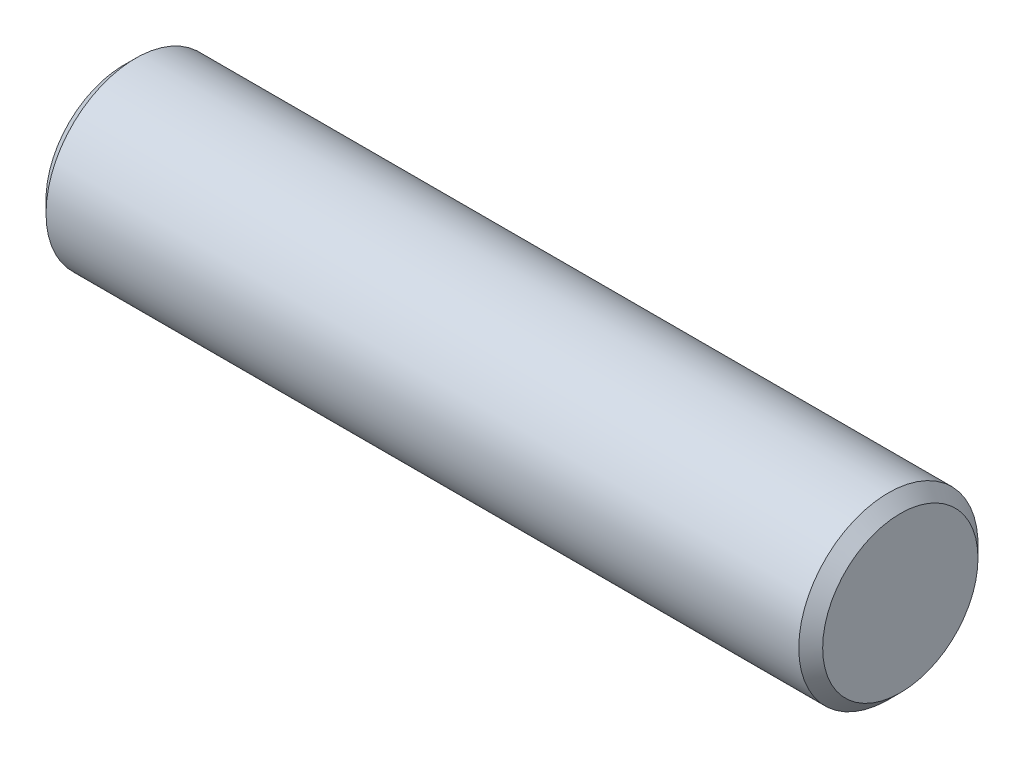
from build123d import *

# Parameters (mm, degrees)
SKETCH1_R           = 0.75
BOSS_EXTRUDE1_DEPTH = 6.5
CHAMFER1_SIZE       = 0.1


with BuildPart() as part:
    # Sketch1 → Boss-Extrude1 (new body)
    with BuildSketch(Plane(origin=(0, 0, 0), x_dir=(0, 0, -1), z_dir=(1, 0, 0))):
        with Locations(Location((0, 0, 0), (0, 0, 180))):
            Circle(SKETCH1_R)
    extrude(amount=BOSS_EXTRUDE1_DEPTH)

    # Chamfer1
    chamfer1_edges = [part.edges().sort_by_distance(p)[0] for p in [
        (0, 0, -0.75),
        (6.5, 0, -0.75),
    ]]
    chamfer(chamfer1_edges, length=CHAMFER1_SIZE)


solid = part.part
